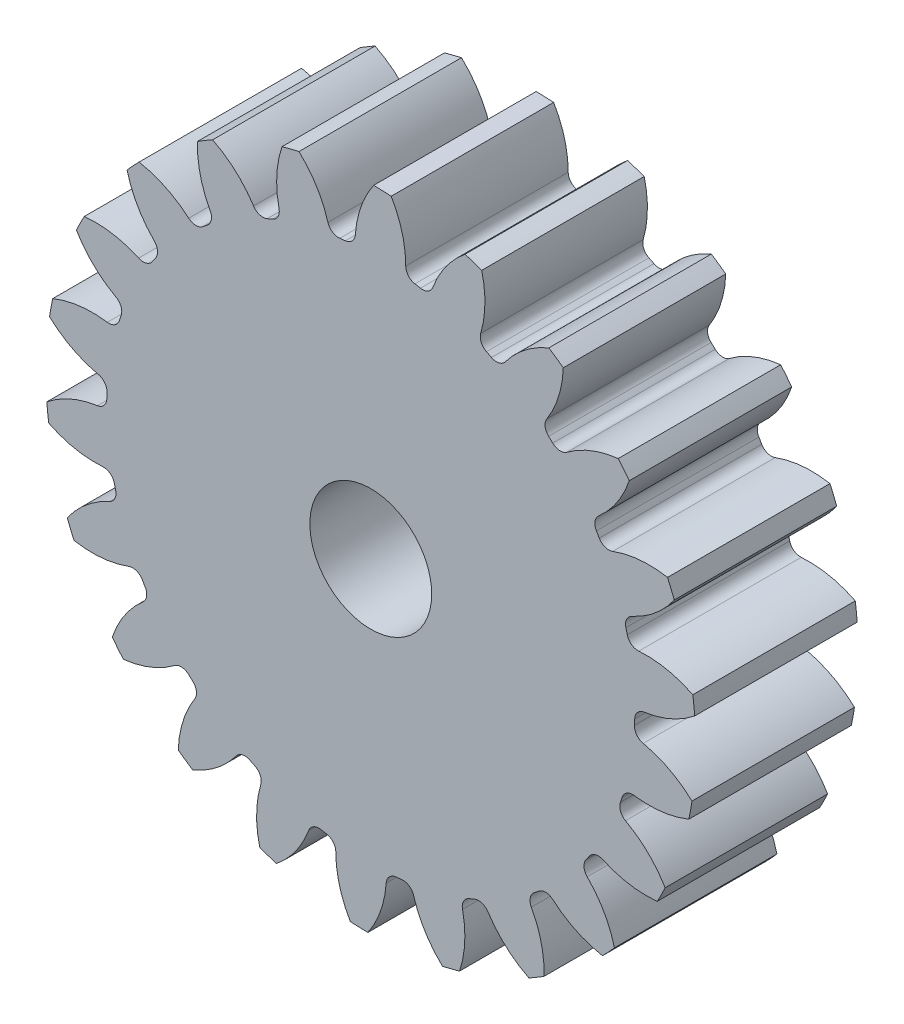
from build123d import *

# Parameters (mm, degrees)
SKETCH3_R         = 203.2
GEARBODY_DEPTH    = 101.6
TOOTHCUT_DEPTH    = 305.8
CIRPATTERN1_COUNT = 22
BOREDIA_R         = 38.1
BORE_DEPTH        = 12700


with BuildPart() as part:
    # Sketch3 → gearBody (new body)
    with BuildSketch(Plane.XY):
        Circle(SKETCH3_R)
    extrude(amount=GEARBODY_DEPTH)

    # Sketch2 → toothCut (cut, through all)
    with BuildSketch(Plane.XY):
        with BuildLine():
            ThreePointArc((164.921531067, -7.67454171), (164.99388491, -5.918440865), (165.047540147, -4.161669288))
            ThreePointArc((165.047540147, -4.161669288), (166.786826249, 0.244051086), (170.95888747, 2.486681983))
            ThreePointArc((170.95888747, 2.486681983), (188.062087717, 7.393813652), (203.2, 16.744910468))
            ThreePointArc((203.2, 16.744910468), (203.75772778, -7.308925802), (201.477996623, -31.260980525))
            ThreePointArc((201.477996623, -31.260980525), (187.048988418, -20.849298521), (170.341336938, -14.729349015))
            ThreePointArc((170.341336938, -14.729349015), (166.340680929, -12.193557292), (164.921531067, -7.67454171))
        make_face()
    toothcut = extrude(amount=TOOTHCUT_DEPTH, mode=Mode.SUBTRACT)

    # CirPattern1: toothCut ×22 about axis
    cirpattern1_axis = Axis((0, 0, 0), (0, 0, 1))
    for i in range(1, CIRPATTERN1_COUNT):
        add(toothcut.rotate(cirpattern1_axis, i * 360 / CIRPATTERN1_COUNT), mode=Mode.SUBTRACT)

    # boreDia → bore (cut, symmetric)
    with BuildSketch(Plane.XY):
        Circle(BOREDIA_R)
    extrude(amount=BORE_DEPTH, both=True, mode=Mode.SUBTRACT)


solid = part.part
